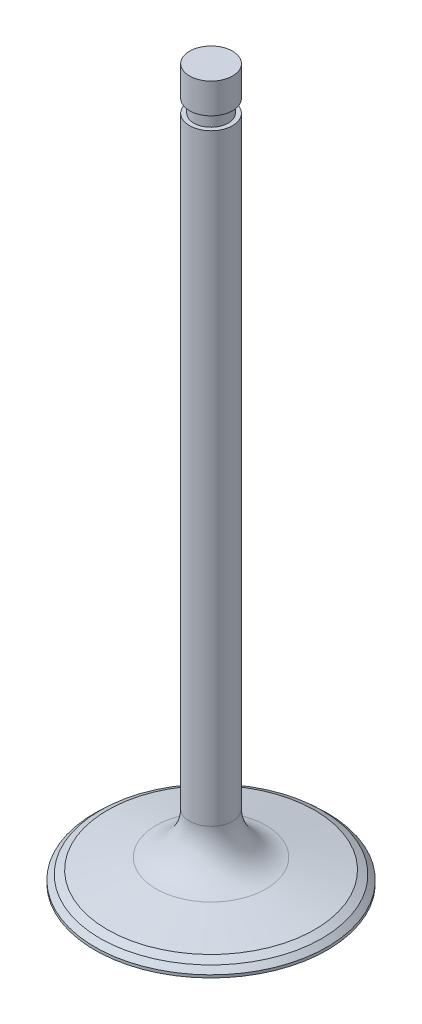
from build123d import *

# Parameters (mm, degrees)
FILLET1_R      = 10
CHAMFER1_SIZE  = 2
CHAMFER1_SIZE2 = 1.36299339
CHAMFER3_SIZE  = 1
CHAMFER3_SIZE2 = 0.999999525


with BuildPart() as part:
    # Sketch1 → Revolve1 (revolve)
    with BuildSketch(Plane.XY, mode=Mode.PRIVATE) as revolve1_sk:
        Polygon((0, 0), (0, 165), (-5, 165), (-5, 158), (-4, 158), (-4, 155), (-5, 155), (-5, 7), (-27, 2), (-27, 0), align=None)
    revolve(revolve1_sk.sketch.rotate(Axis((0, 0, 0), (0, 1, 0)), 270), axis=Axis((0, 0, 0), (0, 1, 0)))

    # Fillet1
    fillet1_edges = [part.edges().sort_by_distance(p)[0] for p in [
        (0, 7, 5),
    ]]
    fillet(fillet1_edges, radius=FILLET1_R)

    # Chamfer1
    chamfer1_edges = [part.edges().sort_by_distance(p)[0] for p in [
        (0, 2, 27),
    ]]
    chamfer1_side = [part.faces().sort_by_distance(p)[0] for p in [
        (0, 3.615478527, 19.891894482),
    ]]
    chamfer(chamfer1_edges, length=CHAMFER1_SIZE, length2=CHAMFER1_SIZE2, reference=chamfer1_side[0])

    # Chamfer3
    chamfer3_edges = [part.edges().sort_by_distance(p)[0] for p in [
        (0, 2.443242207, 25.049727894),
    ]]
    chamfer3_side = [part.faces().sort_by_distance(p)[0] for p in [
        (0, 3.83709963, 18.916761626),
    ]]
    chamfer(chamfer3_edges, length=CHAMFER3_SIZE, length2=CHAMFER3_SIZE2, reference=chamfer3_side[0])


solid = part.part
